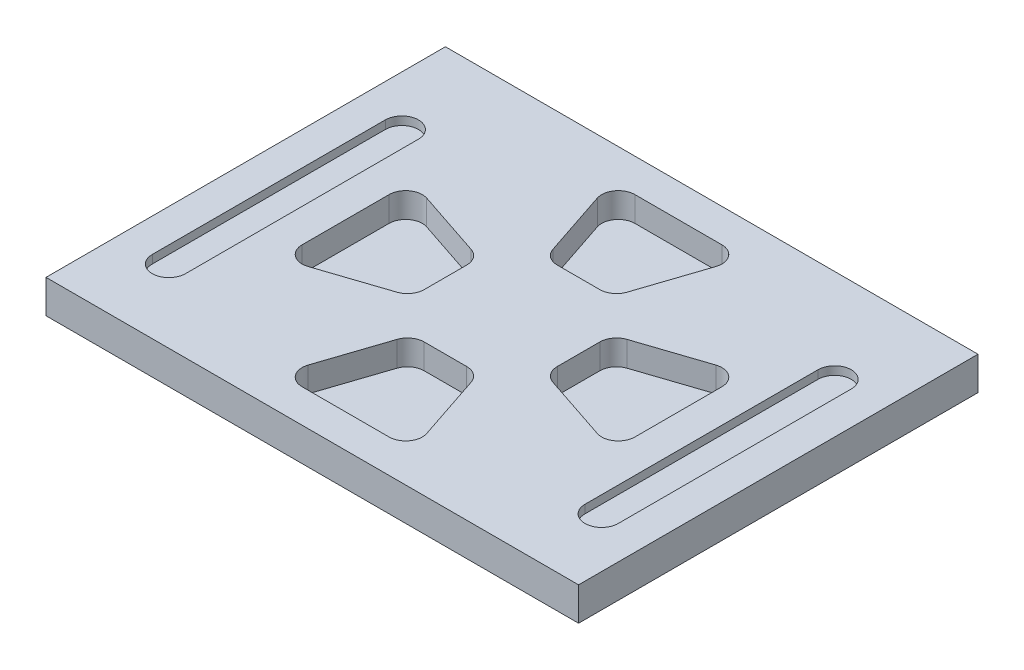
from build123d import *

# Parameters (mm, degrees)
SKETCH1_W           = 406.4
SKETCH1_H           = 304.8
BOSS_EXTRUDE1_DEPTH = 25.4
CUT_EXTRUDE2_DEPTH  = 19.05
CUT_EXTRUDE3_DEPTH  = 6.35
CUT_EXTRUDE4_DEPTH  = 6.35


with BuildPart() as part:
    # Sketch1 → Boss-Extrude1 (new body)
    with BuildSketch(Plane(origin=(0, 0, 0), x_dir=(1, 0, 0), z_dir=(0, 1, 0))):
        Rectangle(SKETCH1_W, SKETCH1_H)
    extrude(amount=-BOSS_EXTRUDE1_DEPTH)

    # Sketch2 → Cut-Extrude2 (cut)
    with BuildSketch(Plane(origin=(0, 0, 0), x_dir=(1, 0, 0), z_dir=(0, 1, 0))):
        with BuildLine():
            Line((-127, 33.179691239), (-127, -33.179691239))
            ThreePointArc((-127, -33.179691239), (-121.725820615, -43.48246699), (-110.283907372, -45.227969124))
            Line((-110.283907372, -45.227969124), (-59.483907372, -28.294635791))
            ThreePointArc((-59.483907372, -28.294635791), (-53.197224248, -23.672178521), (-50.8, -16.246357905))
            Line((-50.8, -16.246357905), (-50.8, 16.246357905))
            ThreePointArc((-50.8, 16.246357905), (-53.197224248, 23.672178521), (-59.483907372, 28.294635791))
            Line((-59.483907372, 28.294635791), (-110.283907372, 45.227969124))
            ThreePointArc((-110.283907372, 45.227969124), (-121.725820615, 43.48246699), (-127, 33.179691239))
        make_face()
        with BuildLine():
            Line((33.179691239, 127), (-33.179691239, 127))
            ThreePointArc((-33.179691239, 127), (-43.48246699, 121.725820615), (-45.227969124, 110.283907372))
            Line((-45.227969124, 110.283907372), (-28.294635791, 59.483907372))
            ThreePointArc((-28.294635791, 59.483907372), (-23.672178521, 53.197224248), (-16.246357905, 50.8))
            Line((-16.246357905, 50.8), (16.246357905, 50.8))
            ThreePointArc((16.246357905, 50.8), (23.672178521, 53.197224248), (28.294635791, 59.483907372))
            Line((28.294635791, 59.483907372), (45.227969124, 110.283907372))
            ThreePointArc((45.227969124, 110.283907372), (43.48246699, 121.725820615), (33.179691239, 127))
        make_face()
        with BuildLine():
            Line((127, -33.179691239), (127, 33.179691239))
            ThreePointArc((127, 33.179691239), (121.725820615, 43.48246699), (110.283907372, 45.227969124))
            Line((110.283907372, 45.227969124), (59.483907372, 28.294635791))
            ThreePointArc((59.483907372, 28.294635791), (53.197224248, 23.672178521), (50.8, 16.246357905))
            Line((50.8, 16.246357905), (50.8, -16.246357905))
            ThreePointArc((50.8, -16.246357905), (53.197224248, -23.672178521), (59.483907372, -28.294635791))
            Line((59.483907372, -28.294635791), (110.283907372, -45.227969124))
            ThreePointArc((110.283907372, -45.227969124), (121.725820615, -43.48246699), (127, -33.179691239))
        make_face()
        with BuildLine():
            Line((-33.179691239, -127), (33.179691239, -127))
            ThreePointArc((33.179691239, -127), (43.48246699, -121.725820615), (45.227969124, -110.283907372))
            Line((45.227969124, -110.283907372), (28.294635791, -59.483907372))
            ThreePointArc((28.294635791, -59.483907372), (23.672178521, -53.197224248), (16.246357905, -50.8))
            Line((16.246357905, -50.8), (-16.246357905, -50.8))
            ThreePointArc((-16.246357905, -50.8), (-23.672178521, -53.197224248), (-28.294635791, -59.483907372))
            Line((-28.294635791, -59.483907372), (-45.227969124, -110.283907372))
            ThreePointArc((-45.227969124, -110.283907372), (-43.48246699, -121.725820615), (-33.179691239, -127))
        make_face()
    extrude(amount=-CUT_EXTRUDE2_DEPTH, mode=Mode.SUBTRACT)

    # Sketch3 → Cut-Extrude3 (cut)
    with BuildSketch(Plane(origin=(0, 0, 0), x_dir=(1, 0, 0), z_dir=(0, 1, 0))):
        with BuildLine():
            Line((-177.8, -96.708280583), (-177.8, 81.091719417))
            ThreePointArc((-177.8, 81.091719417), (-165.1, 93.791719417), (-152.4, 81.091719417))
            Line((-152.4, 81.091719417), (-152.4, -96.708280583))
            ThreePointArc((-152.4, -96.708280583), (-165.1, -109.408280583), (-177.8, -96.708280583))
        make_face()
        with BuildLine():
            Line((177.8, -96.708280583), (177.8, 81.091719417))
            ThreePointArc((177.8, 81.091719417), (165.1, 93.791719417), (152.4, 81.091719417))
            Line((152.4, 81.091719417), (152.4, -96.708280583))
            ThreePointArc((152.4, -96.708280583), (165.1, -109.408280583), (177.8, -96.708280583))
        make_face()
    extrude(amount=-CUT_EXTRUDE3_DEPTH, mode=Mode.SUBTRACT)

    # Sketch4 → Cut-Extrude4 (cut)
    with BuildSketch(Plane.XZ.offset(25.4)):
        with BuildLine():
            Line((177.8, 88.9), (177.8, -88.9))
            ThreePointArc((177.8, -88.9), (165.1, -101.6), (152.4, -88.9))
            Line((152.4, -88.9), (152.4, 88.9))
            ThreePointArc((152.4, 88.9), (165.1, 101.6), (177.8, 88.9))
        make_face()
        with BuildLine():
            Line((-177.8, 88.9), (-177.8, -88.9))
            ThreePointArc((-177.8, -88.9), (-165.1, -101.6), (-152.4, -88.9))
            Line((-152.4, -88.9), (-152.4, 88.9))
            ThreePointArc((-152.4, 88.9), (-165.1, 101.6), (-177.8, 88.9))
        make_face()
    extrude(amount=-CUT_EXTRUDE4_DEPTH, mode=Mode.SUBTRACT)


solid = part.part
